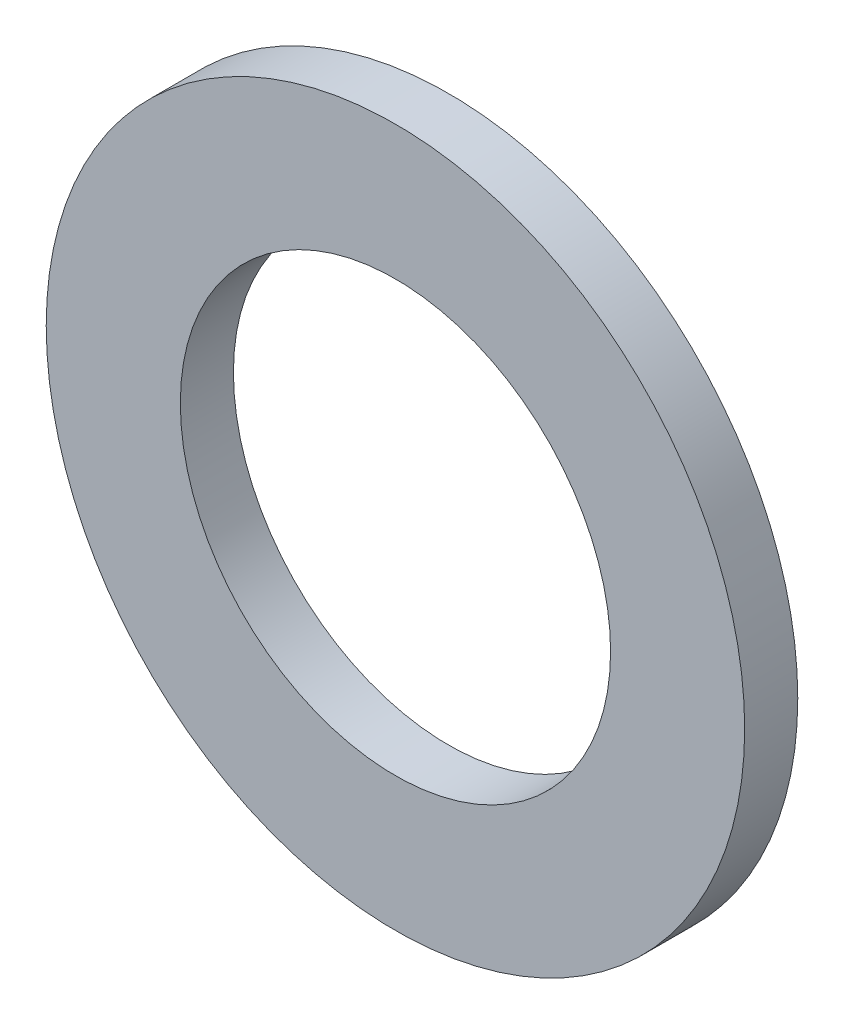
ISO-10303-21;
HEADER;
FILE_DESCRIPTION(('STEP AP214'),'2;1');
FILE_NAME('part.step','',(''),(''),'','','');
FILE_SCHEMA(('AUTOMOTIVE_DESIGN { 1 0 10303 214 1 1 1 1 }'));
ENDSEC;
DATA;
#1=APPLICATION_CONTEXT('core data for automotive mechanical design processes');
#2=APPLICATION_PROTOCOL_DEFINITION('international standard','automotive_design',2000,#1);
#3=PRODUCT_CONTEXT('',#1,'mechanical');
#4=PRODUCT('Part','Part','',(#3));
#5=PRODUCT_RELATED_PRODUCT_CATEGORY('part','',(#4));
#6=PRODUCT_DEFINITION_FORMATION('','',#4);
#7=PRODUCT_DEFINITION_CONTEXT('part definition',#1,'design');
#8=PRODUCT_DEFINITION('design','',#6,#7);
#9=PRODUCT_DEFINITION_SHAPE('','',#8);
#10=(LENGTH_UNIT() NAMED_UNIT(*) SI_UNIT(.MILLI.,.METRE.));
#11=(NAMED_UNIT(*) PLANE_ANGLE_UNIT() SI_UNIT($,.RADIAN.));
#12=(NAMED_UNIT(*) SI_UNIT($,.STERADIAN.) SOLID_ANGLE_UNIT());
#13=UNCERTAINTY_MEASURE_WITH_UNIT(LENGTH_MEASURE(1.E-05),#10,'distance_accuracy_value','');
#14=(GEOMETRIC_REPRESENTATION_CONTEXT(3) GLOBAL_UNCERTAINTY_ASSIGNED_CONTEXT((#13)) GLOBAL_UNIT_ASSIGNED_CONTEXT((#10,
#11,#12)) REPRESENTATION_CONTEXT('',''));
#15=CARTESIAN_POINT('',(0.,0.,0.));
#16=DIRECTION('',(0.,0.,1.));
#17=DIRECTION('',(1.,0.,0.));
#18=AXIS2_PLACEMENT_3D('',#15,#16,#17);
#19=CARTESIAN_POINT('',(0.,0.,2.413));
#20=DIRECTION('',(0.,0.,1.));
#21=DIRECTION('',(1.,0.,0.));
#22=AXIS2_PLACEMENT_3D('',#19,#20,#21);
#23=PLANE('',#22);
#24=CARTESIAN_POINT('',(0.,0.,2.413));
#25=DIRECTION('',(0.,0.,1.));
#26=DIRECTION('',(1.,0.,0.));
#27=AXIS2_PLACEMENT_3D('',#24,#25,#26);
#28=CIRCLE('',#27,15.875);
#29=CARTESIAN_POINT('',(15.875,0.,2.413));
#30=VERTEX_POINT('',#29);
#31=EDGE_CURVE('E10',#30,#30,#28,.T.);
#32=ORIENTED_EDGE('',*,*,#31,.T.);
#33=EDGE_LOOP('',(#32));
#34=FACE_BOUND('',#33,.T.);
#35=CARTESIAN_POINT('',(0.,0.,2.413));
#36=DIRECTION('',(0.,0.,1.));
#37=DIRECTION('',(1.,0.,0.));
#38=AXIS2_PLACEMENT_3D('',#35,#36,#37);
#39=CIRCLE('',#38,9.779);
#40=CARTESIAN_POINT('',(9.779,0.,2.413));
#41=VERTEX_POINT('',#40);
#42=EDGE_CURVE('E40',#41,#41,#39,.T.);
#43=ORIENTED_EDGE('',*,*,#42,.F.);
#44=EDGE_LOOP('',(#43));
#45=FACE_BOUND('',#44,.T.);
#46=ADVANCED_FACE('F29',(#34,#45),#23,.T.);
#47=CARTESIAN_POINT('',(0.,0.,0.));
#48=DIRECTION('',(0.,0.,1.));
#49=DIRECTION('',(1.,0.,0.));
#50=AXIS2_PLACEMENT_3D('',#47,#48,#49);
#51=PLANE('',#50);
#52=CARTESIAN_POINT('',(0.,0.,0.));
#53=DIRECTION('',(0.,0.,1.));
#54=DIRECTION('',(1.,0.,0.));
#55=AXIS2_PLACEMENT_3D('',#52,#53,#54);
#56=CIRCLE('',#55,15.875);
#57=CARTESIAN_POINT('',(15.875,0.,0.));
#58=VERTEX_POINT('',#57);
#59=EDGE_CURVE('E36',#58,#58,#56,.T.);
#60=ORIENTED_EDGE('',*,*,#59,.F.);
#61=EDGE_LOOP('',(#60));
#62=FACE_BOUND('',#61,.T.);
#63=CARTESIAN_POINT('',(0.,0.,0.));
#64=DIRECTION('',(0.,0.,1.));
#65=DIRECTION('',(1.,0.,0.));
#66=AXIS2_PLACEMENT_3D('',#63,#64,#65);
#67=CIRCLE('',#66,9.779);
#68=CARTESIAN_POINT('',(9.779,0.,0.));
#69=VERTEX_POINT('',#68);
#70=EDGE_CURVE('E44',#69,#69,#67,.T.);
#71=ORIENTED_EDGE('',*,*,#70,.T.);
#72=EDGE_LOOP('',(#71));
#73=FACE_BOUND('',#72,.T.);
#74=ADVANCED_FACE('F50',(#62,#73),#51,.F.);
#75=CARTESIAN_POINT('',(0.,0.,2.413));
#76=DIRECTION('',(0.,0.,-1.));
#77=DIRECTION('',(-1.,0.,0.));
#78=AXIS2_PLACEMENT_3D('',#75,#76,#77);
#79=CYLINDRICAL_SURFACE('',#78,15.875);
#80=ORIENTED_EDGE('',*,*,#31,.F.);
#81=EDGE_LOOP('',(#80));
#82=FACE_BOUND('',#81,.T.);
#83=ORIENTED_EDGE('',*,*,#59,.T.);
#84=EDGE_LOOP('',(#83));
#85=FACE_BOUND('',#84,.T.);
#86=ADVANCED_FACE('F31',(#82,#85),#79,.T.);
#87=CARTESIAN_POINT('',(0.,0.,2.413));
#88=DIRECTION('',(0.,0.,-1.));
#89=DIRECTION('',(-1.,0.,0.));
#90=AXIS2_PLACEMENT_3D('',#87,#88,#89);
#91=CYLINDRICAL_SURFACE('',#90,9.779);
#92=ORIENTED_EDGE('',*,*,#42,.T.);
#93=EDGE_LOOP('',(#92));
#94=FACE_BOUND('',#93,.T.);
#95=ORIENTED_EDGE('',*,*,#70,.F.);
#96=EDGE_LOOP('',(#95));
#97=FACE_BOUND('',#96,.T.);
#98=ADVANCED_FACE('F52',(#94,#97),#91,.F.);
#99=CLOSED_SHELL('',(#46,#74,#86,#98));
#100=MANIFOLD_SOLID_BREP('B2',#99);
#101=ADVANCED_BREP_SHAPE_REPRESENTATION('',(#18,#100),#14);
#102=SHAPE_DEFINITION_REPRESENTATION(#9,#101);
ENDSEC;
END-ISO-10303-21;
